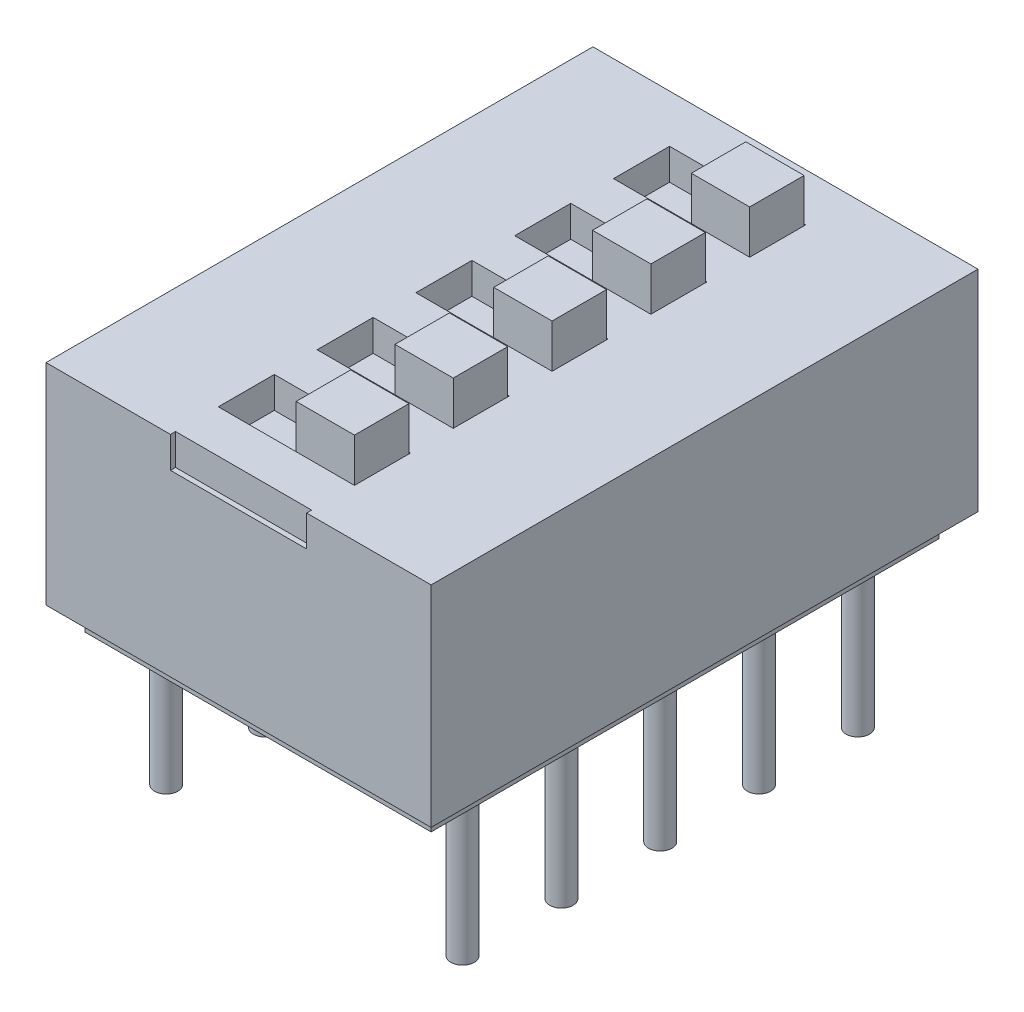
from build123d import *

# Parameters (mm, degrees)
ESQUISSE1_W             = 9.9
ESQUISSE1_H             = 5.4
BOSS_EXTRU_1_DEPTH      = 14.06
ESQUISSE2_W             = 3.5
ESQUISSE2_H             = 1.44
ESQUISSE2_H_2           = 0.223306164
ENL_V_MAT_EXTRU_1_DEPTH = 0.8
ESQUISSE3_W             = 1.5
ESQUISSE3_H             = 1.4
BOSS_EXTRU_2_DEPTH      = 1.9
ESQUISSE4_W             = 8.9
ESQUISSE4_H             = 13.06
BOSS_EXTRU_3_DEPTH      = 0.6
ESQUISSE5_R             = 0.3
BOSS_EXTRU_4_DEPTH      = 3.8


with BuildPart() as part:
    # Esquisse1 → Boss.-Extru.1 (new body)
    with BuildSketch(Plane.XY):
        with Locations((0, 2.7)):
            Rectangle(ESQUISSE1_W, ESQUISSE1_H)
    extrude(amount=BOSS_EXTRU_1_DEPTH)

    # Esquisse2 → Enl_v. mat.-Extru.1 (cut)
    with BuildSketch(Plane(origin=(0, 5.4, 0), x_dir=(1, 0, 0), z_dir=(0, 1, 0))):
        with Locations((0, -4.49)):
            Rectangle(ESQUISSE2_W, ESQUISSE2_H)
        with Locations((0, -1.95)):
            Rectangle(ESQUISSE2_W, ESQUISSE2_H)
        with Locations((0, -7.03)):
            Rectangle(ESQUISSE2_W, ESQUISSE2_H)
        with Locations((0, -9.57)):
            Rectangle(ESQUISSE2_W, ESQUISSE2_H)
        with Locations((0, -12.11)):
            Rectangle(ESQUISSE2_W, ESQUISSE2_H)
        with Locations((0, -14.041653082)):
            Rectangle(ESQUISSE2_W, ESQUISSE2_H_2)
    extrude(amount=-ENL_V_MAT_EXTRU_1_DEPTH, mode=Mode.SUBTRACT)

    # Esquisse3 → Boss.-Extru.2 (add)
    with BuildSketch(Plane(origin=(0, 4.6, 0), x_dir=(1, 0, 0), z_dir=(0, 1, 0))):
        with Locations((0.98, -4.49)):
            Rectangle(ESQUISSE3_W, ESQUISSE3_H)
        with Locations((0.98, -1.95)):
            Rectangle(ESQUISSE3_W, ESQUISSE3_H)
        with Locations((0.98, -7.03)):
            Rectangle(ESQUISSE3_W, ESQUISSE3_H)
        with Locations((0.98, -9.57)):
            Rectangle(ESQUISSE3_W, ESQUISSE3_H)
        with Locations((0.98, -12.11)):
            Rectangle(ESQUISSE3_W, ESQUISSE3_H)
    extrude(amount=BOSS_EXTRU_2_DEPTH)

    # Esquisse4 → Boss.-Extru.3 (add)
    with BuildSketch(Plane.XZ):
        with Locations((0, 7.03)):
            Rectangle(ESQUISSE4_W, ESQUISSE4_H)
    extrude(amount=BOSS_EXTRU_3_DEPTH)

    # Esquisse5 → Boss.-Extru.4 (add)
    with BuildSketch(Plane.XZ.offset(0.6)):
        with Locations(Location((3.81, 1.95, 0), (0, 0, 270))):
            Circle(ESQUISSE5_R)
        with Locations(Location((3.81, 4.49, 0), (0, 0, 270))):
            Circle(ESQUISSE5_R)
        with Locations(Location((3.81, 7.03, 0), (0, 0, 270))):
            Circle(ESQUISSE5_R)
        with Locations(Location((3.81, 9.57, 0), (0, 0, 270))):
            Circle(ESQUISSE5_R)
        with Locations(Location((3.81, 12.11, 0), (0, 0, 270))):
            Circle(ESQUISSE5_R)
        with Locations(Location((-3.81, 1.95, 0), (0, 0, 270))):
            Circle(ESQUISSE5_R)
        with Locations(Location((-3.81, 4.49, 0), (0, 0, 270))):
            Circle(ESQUISSE5_R)
        with Locations(Location((-3.81, 7.03, 0), (0, 0, 270))):
            Circle(ESQUISSE5_R)
        with Locations(Location((-3.81, 9.57, 0), (0, 0, 270))):
            Circle(ESQUISSE5_R)
        with Locations(Location((-3.81, 12.11, 0), (0, 0, 270))):
            Circle(ESQUISSE5_R)
    extrude(amount=BOSS_EXTRU_4_DEPTH)


solid = part.part
